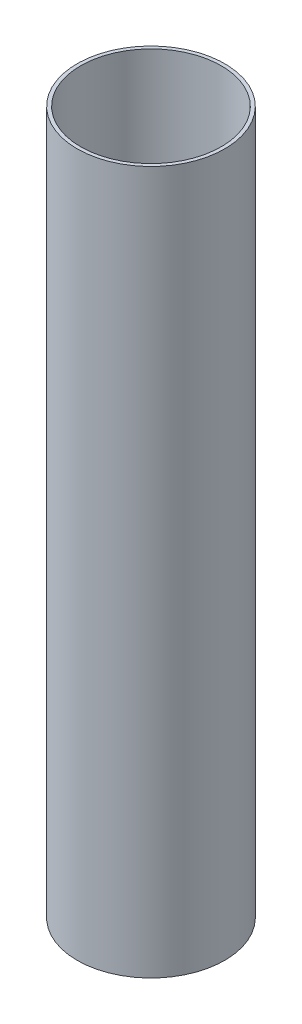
from build123d import *

# Parameters (mm, degrees)
ESQUISSE1_R        = 21
ESQUISSE1_R_2      = 20
BOSS_EXTRU_1_DEPTH = 200


with BuildPart() as part:
    # Esquisse1 → Boss.-Extru.1 (new body)
    with BuildSketch(Plane(origin=(0, 0, 0), x_dir=(1, 0, 0), z_dir=(0, 1, 0))):
        with Locations(Location((0, 0, 0), (0, 0, 270))):
            Circle(ESQUISSE1_R)
        with Locations(Location((0, 0, 0), (0, 0, 270))):
            Circle(ESQUISSE1_R_2, mode=Mode.SUBTRACT)
    extrude(amount=BOSS_EXTRU_1_DEPTH)


solid = part.part
